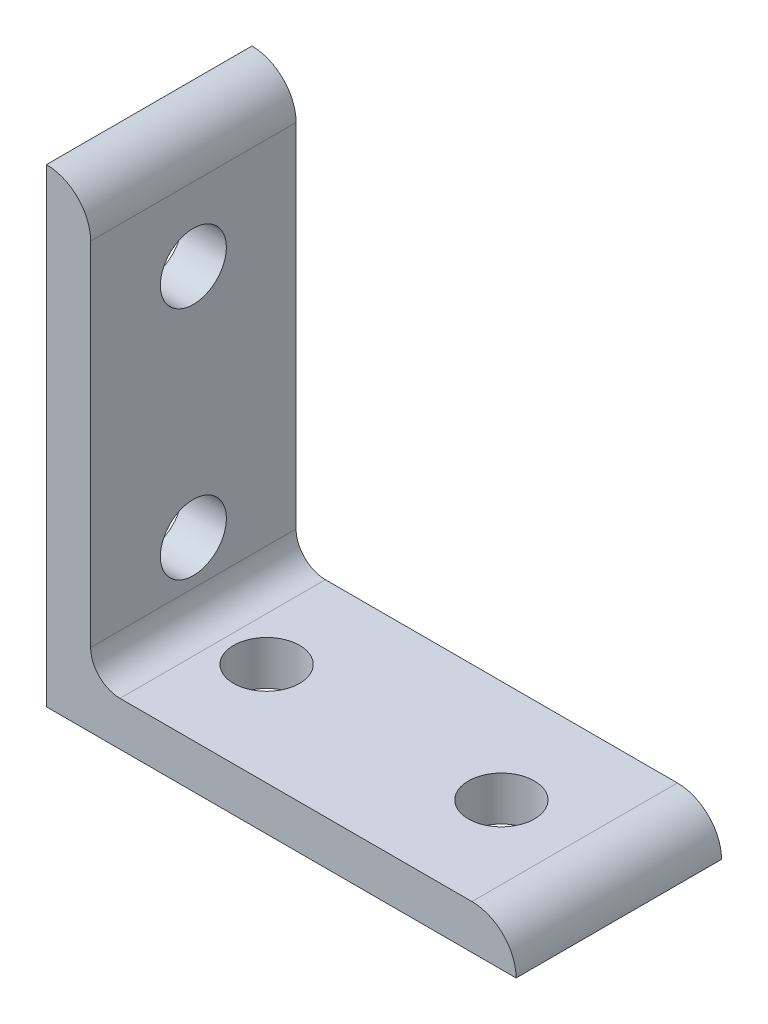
ISO-10303-21;
HEADER;
FILE_DESCRIPTION(('STEP AP214'),'2;1');
FILE_NAME('part.step','',(''),(''),'','','');
FILE_SCHEMA(('AUTOMOTIVE_DESIGN { 1 0 10303 214 1 1 1 1 }'));
ENDSEC;
DATA;
#1=APPLICATION_CONTEXT('core data for automotive mechanical design processes');
#2=APPLICATION_PROTOCOL_DEFINITION('international standard','automotive_design',2000,#1);
#3=PRODUCT_CONTEXT('',#1,'mechanical');
#4=PRODUCT('Part','Part','',(#3));
#5=PRODUCT_RELATED_PRODUCT_CATEGORY('part','',(#4));
#6=PRODUCT_DEFINITION_FORMATION('','',#4);
#7=PRODUCT_DEFINITION_CONTEXT('part definition',#1,'design');
#8=PRODUCT_DEFINITION('design','',#6,#7);
#9=PRODUCT_DEFINITION_SHAPE('','',#8);
#10=(LENGTH_UNIT() NAMED_UNIT(*) SI_UNIT(.MILLI.,.METRE.));
#11=(NAMED_UNIT(*) PLANE_ANGLE_UNIT() SI_UNIT($,.RADIAN.));
#12=(NAMED_UNIT(*) SI_UNIT($,.STERADIAN.) SOLID_ANGLE_UNIT());
#13=UNCERTAINTY_MEASURE_WITH_UNIT(LENGTH_MEASURE(1.E-05),#10,'distance_accuracy_value','');
#14=(GEOMETRIC_REPRESENTATION_CONTEXT(3) GLOBAL_UNCERTAINTY_ASSIGNED_CONTEXT((#13)) GLOBAL_UNIT_ASSIGNED_CONTEXT((#10,
#11,#12)) REPRESENTATION_CONTEXT('',''));
#15=CARTESIAN_POINT('',(0.,0.,0.));
#16=DIRECTION('',(0.,0.,1.));
#17=DIRECTION('',(1.,0.,0.));
#18=AXIS2_PLACEMENT_3D('',#15,#16,#17);
#19=CARTESIAN_POINT('',(4.7752,46.0248,11.1125));
#20=DIRECTION('',(-1.,0.,0.));
#21=DIRECTION('',(0.,-1.,0.));
#22=AXIS2_PLACEMENT_3D('',#19,#20,#21);
#23=PLANE('',#22);
#24=CARTESIAN_POINT('',(4.7752,12.7,0.));
#25=DIRECTION('',(-1.,0.,0.));
#26=DIRECTION('',(0.,-1.,0.));
#27=AXIS2_PLACEMENT_3D('',#24,#25,#26);
#28=CIRCLE('',#27,3.5687);
#29=CARTESIAN_POINT('',(4.77520000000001,12.7,3.5687));
#30=VERTEX_POINT('',#29);
#31=EDGE_CURVE('E194',#30,#30,#28,.F.);
#32=ORIENTED_EDGE('',*,*,#31,.F.);
#33=EDGE_LOOP('',(#32));
#34=FACE_BOUND('',#33,.T.);
#35=DIRECTION('',(0.,1.,0.));
#36=VECTOR('',#35,1.);
#37=CARTESIAN_POINT('',(4.7752,46.0248,-11.1125));
#38=LINE('',#37,#36);
#39=CARTESIAN_POINT('',(4.7752,7.9502,-11.1125));
#40=VERTEX_POINT('',#39);
#41=CARTESIAN_POINT('',(4.77519999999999,46.0248,-11.1125));
#42=VERTEX_POINT('',#41);
#43=EDGE_CURVE('E115',#40,#42,#38,.T.);
#44=ORIENTED_EDGE('',*,*,#43,.T.);
#45=DIRECTION('',(0.,0.,-1.));
#46=VECTOR('',#45,1.);
#47=CARTESIAN_POINT('',(4.77519999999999,46.0248,11.1125));
#48=LINE('',#47,#46);
#49=CARTESIAN_POINT('',(4.77519999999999,46.0248,11.1125));
#50=VERTEX_POINT('',#49);
#51=EDGE_CURVE('E112',#50,#42,#48,.T.);
#52=ORIENTED_EDGE('',*,*,#51,.F.);
#53=DIRECTION('',(0.,1.,0.));
#54=VECTOR('',#53,1.);
#55=CARTESIAN_POINT('',(4.7752,46.0248,11.1125));
#56=LINE('',#55,#54);
#57=CARTESIAN_POINT('',(4.7752,7.9502,11.1125));
#58=VERTEX_POINT('',#57);
#59=EDGE_CURVE('E101',#58,#50,#56,.T.);
#60=ORIENTED_EDGE('',*,*,#59,.F.);
#61=DIRECTION('',(0.,0.,-1.));
#62=VECTOR('',#61,1.);
#63=CARTESIAN_POINT('',(4.7752,7.9502,11.1125));
#64=LINE('',#63,#62);
#65=EDGE_CURVE('E116',#58,#40,#64,.T.);
#66=ORIENTED_EDGE('',*,*,#65,.T.);
#67=EDGE_LOOP('',(#44,#52,#60,#66));
#68=FACE_BOUND('',#67,.T.);
#69=CARTESIAN_POINT('',(4.77519999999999,38.1,0.));
#70=DIRECTION('',(-1.,0.,0.));
#71=DIRECTION('',(0.,-1.,0.));
#72=AXIS2_PLACEMENT_3D('',#69,#70,#71);
#73=CIRCLE('',#72,3.5687);
#74=CARTESIAN_POINT('',(4.77519999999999,38.1,3.5687));
#75=VERTEX_POINT('',#74);
#76=EDGE_CURVE('E187',#75,#75,#73,.F.);
#77=ORIENTED_EDGE('',*,*,#76,.F.);
#78=EDGE_LOOP('',(#77));
#79=FACE_BOUND('',#78,.T.);
#80=ADVANCED_FACE('F32',(#34,#68,#79),#23,.F.);
#81=CARTESIAN_POINT('',(0.,0.,11.1125));
#82=DIRECTION('',(1.,0.,0.));
#83=DIRECTION('',(0.,0.,-1.));
#84=AXIS2_PLACEMENT_3D('',#81,#82,#83);
#85=PLANE('',#84);
#86=CARTESIAN_POINT('',(0.,12.7,0.));
#87=DIRECTION('',(1.,0.,0.));
#88=DIRECTION('',(0.,0.,-1.));
#89=AXIS2_PLACEMENT_3D('',#86,#87,#88);
#90=CIRCLE('',#89,3.5687);
#91=CARTESIAN_POINT('',(0.,12.7,3.5687));
#92=VERTEX_POINT('',#91);
#93=EDGE_CURVE('E190',#92,#92,#90,.T.);
#94=ORIENTED_EDGE('',*,*,#93,.T.);
#95=EDGE_LOOP('',(#94));
#96=FACE_BOUND('',#95,.T.);
#97=DIRECTION('',(0.,-1.,0.));
#98=VECTOR('',#97,1.);
#99=CARTESIAN_POINT('',(0.,0.,-11.1125));
#100=LINE('',#99,#98);
#101=CARTESIAN_POINT('',(0.,50.8,-11.1125));
#102=VERTEX_POINT('',#101);
#103=CARTESIAN_POINT('',(0.,0.,-11.1125));
#104=VERTEX_POINT('',#103);
#105=EDGE_CURVE('E83',#102,#104,#100,.T.);
#106=ORIENTED_EDGE('',*,*,#105,.T.);
#107=DIRECTION('',(0.,0.,-1.));
#108=VECTOR('',#107,1.);
#109=CARTESIAN_POINT('',(0.,0.,11.1125));
#110=LINE('',#109,#108);
#111=CARTESIAN_POINT('',(0.,0.,11.1125));
#112=VERTEX_POINT('',#111);
#113=EDGE_CURVE('E121',#112,#104,#110,.T.);
#114=ORIENTED_EDGE('',*,*,#113,.F.);
#115=DIRECTION('',(0.,-1.,0.));
#116=VECTOR('',#115,1.);
#117=CARTESIAN_POINT('',(0.,0.,11.1125));
#118=LINE('',#117,#116);
#119=CARTESIAN_POINT('',(0.,50.8,11.1125));
#120=VERTEX_POINT('',#119);
#121=EDGE_CURVE('E51',#120,#112,#118,.T.);
#122=ORIENTED_EDGE('',*,*,#121,.F.);
#123=DIRECTION('',(0.,0.,-1.));
#124=VECTOR('',#123,1.);
#125=CARTESIAN_POINT('',(0.,50.8,11.1125));
#126=LINE('',#125,#124);
#127=EDGE_CURVE('E117',#120,#102,#126,.T.);
#128=ORIENTED_EDGE('',*,*,#127,.T.);
#129=EDGE_LOOP('',(#106,#114,#122,#128));
#130=FACE_BOUND('',#129,.T.);
#131=CARTESIAN_POINT('',(0.,38.1,0.));
#132=DIRECTION('',(1.,0.,0.));
#133=DIRECTION('',(0.,0.,-1.));
#134=AXIS2_PLACEMENT_3D('',#131,#132,#133);
#135=CIRCLE('',#134,3.5687);
#136=CARTESIAN_POINT('',(0.,38.1,3.5687));
#137=VERTEX_POINT('',#136);
#138=EDGE_CURVE('E185',#137,#137,#135,.T.);
#139=ORIENTED_EDGE('',*,*,#138,.T.);
#140=EDGE_LOOP('',(#139));
#141=FACE_BOUND('',#140,.T.);
#142=ADVANCED_FACE('F178',(#96,#130,#141),#85,.F.);
#143=CARTESIAN_POINT('',(50.8,0.,11.1125));
#144=DIRECTION('',(0.,1.,0.));
#145=DIRECTION('',(-1.,0.,0.));
#146=AXIS2_PLACEMENT_3D('',#143,#144,#145);
#147=PLANE('',#146);
#148=CARTESIAN_POINT('',(12.7,0.,0.));
#149=DIRECTION('',(0.,1.,0.));
#150=DIRECTION('',(0.,0.,1.));
#151=AXIS2_PLACEMENT_3D('',#148,#149,#150);
#152=CIRCLE('',#151,3.5687);
#153=CARTESIAN_POINT('',(12.7,0.,-3.5687));
#154=VERTEX_POINT('',#153);
#155=EDGE_CURVE('E147',#154,#154,#152,.T.);
#156=ORIENTED_EDGE('',*,*,#155,.T.);
#157=EDGE_LOOP('',(#156));
#158=FACE_BOUND('',#157,.T.);
#159=DIRECTION('',(1.,0.,0.));
#160=VECTOR('',#159,1.);
#161=CARTESIAN_POINT('',(50.8,0.,-11.1125));
#162=LINE('',#161,#160);
#163=CARTESIAN_POINT('',(50.8,0.,-11.1125));
#164=VERTEX_POINT('',#163);
#165=EDGE_CURVE('E125',#104,#164,#162,.T.);
#166=ORIENTED_EDGE('',*,*,#165,.T.);
#167=DIRECTION('',(0.,0.,-1.));
#168=VECTOR('',#167,1.);
#169=CARTESIAN_POINT('',(50.8,0.,11.1125));
#170=LINE('',#169,#168);
#171=CARTESIAN_POINT('',(50.8,0.,11.1125));
#172=VERTEX_POINT('',#171);
#173=EDGE_CURVE('E11',#172,#164,#170,.T.);
#174=ORIENTED_EDGE('',*,*,#173,.F.);
#175=DIRECTION('',(1.,0.,0.));
#176=VECTOR('',#175,1.);
#177=CARTESIAN_POINT('',(50.8,0.,11.1125));
#178=LINE('',#177,#176);
#179=EDGE_CURVE('E138',#112,#172,#178,.T.);
#180=ORIENTED_EDGE('',*,*,#179,.F.);
#181=ORIENTED_EDGE('',*,*,#113,.T.);
#182=EDGE_LOOP('',(#166,#174,#180,#181));
#183=FACE_BOUND('',#182,.T.);
#184=CARTESIAN_POINT('',(38.1,0.,0.));
#185=DIRECTION('',(0.,1.,0.));
#186=DIRECTION('',(0.,0.,1.));
#187=AXIS2_PLACEMENT_3D('',#184,#185,#186);
#188=CIRCLE('',#187,3.56869999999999);
#189=CARTESIAN_POINT('',(38.1,0.,-3.56869999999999));
#190=VERTEX_POINT('',#189);
#191=EDGE_CURVE('E155',#190,#190,#188,.T.);
#192=ORIENTED_EDGE('',*,*,#191,.T.);
#193=EDGE_LOOP('',(#192));
#194=FACE_BOUND('',#193,.T.);
#195=ADVANCED_FACE('F34',(#158,#183,#194),#147,.F.);
#196=CARTESIAN_POINT('',(7.9502,4.7752,11.1125));
#197=DIRECTION('',(0.,-1.,0.));
#198=DIRECTION('',(1.,0.,0.));
#199=AXIS2_PLACEMENT_3D('',#196,#197,#198);
#200=PLANE('',#199);
#201=CARTESIAN_POINT('',(12.7,4.7752,0.));
#202=DIRECTION('',(0.,-1.,0.));
#203=DIRECTION('',(1.,0.,0.));
#204=AXIS2_PLACEMENT_3D('',#201,#202,#203);
#205=CIRCLE('',#204,3.5687);
#206=CARTESIAN_POINT('',(12.7,4.77520000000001,-3.5687));
#207=VERTEX_POINT('',#206);
#208=EDGE_CURVE('E129',#207,#207,#205,.F.);
#209=ORIENTED_EDGE('',*,*,#208,.F.);
#210=EDGE_LOOP('',(#209));
#211=FACE_BOUND('',#210,.T.);
#212=DIRECTION('',(-1.,0.,0.));
#213=VECTOR('',#212,1.);
#214=CARTESIAN_POINT('',(7.9502,4.7752,-11.1125));
#215=LINE('',#214,#213);
#216=CARTESIAN_POINT('',(46.0248,4.7752,-11.1125));
#217=VERTEX_POINT('',#216);
#218=CARTESIAN_POINT('',(7.9502,4.7752,-11.1125));
#219=VERTEX_POINT('',#218);
#220=EDGE_CURVE('E131',#217,#219,#215,.T.);
#221=ORIENTED_EDGE('',*,*,#220,.T.);
#222=DIRECTION('',(0.,0.,-1.));
#223=VECTOR('',#222,1.);
#224=CARTESIAN_POINT('',(7.9502,4.7752,11.1125));
#225=LINE('',#224,#223);
#226=CARTESIAN_POINT('',(7.9502,4.7752,11.1125));
#227=VERTEX_POINT('',#226);
#228=EDGE_CURVE('E142',#227,#219,#225,.T.);
#229=ORIENTED_EDGE('',*,*,#228,.F.);
#230=DIRECTION('',(-1.,0.,0.));
#231=VECTOR('',#230,1.);
#232=CARTESIAN_POINT('',(7.9502,4.7752,11.1125));
#233=LINE('',#232,#231);
#234=CARTESIAN_POINT('',(46.0248,4.7752,11.1125));
#235=VERTEX_POINT('',#234);
#236=EDGE_CURVE('E161',#235,#227,#233,.T.);
#237=ORIENTED_EDGE('',*,*,#236,.F.);
#238=DIRECTION('',(0.,0.,-1.));
#239=VECTOR('',#238,1.);
#240=CARTESIAN_POINT('',(46.0248,4.7752,11.1125));
#241=LINE('',#240,#239);
#242=EDGE_CURVE('E42',#235,#217,#241,.T.);
#243=ORIENTED_EDGE('',*,*,#242,.T.);
#244=EDGE_LOOP('',(#221,#229,#237,#243));
#245=FACE_BOUND('',#244,.T.);
#246=CARTESIAN_POINT('',(38.1,4.7752,0.));
#247=DIRECTION('',(0.,-1.,0.));
#248=DIRECTION('',(1.,0.,0.));
#249=AXIS2_PLACEMENT_3D('',#246,#247,#248);
#250=CIRCLE('',#249,3.56869999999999);
#251=CARTESIAN_POINT('',(38.1,4.77520000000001,-3.56869999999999));
#252=VERTEX_POINT('',#251);
#253=EDGE_CURVE('E36',#252,#252,#250,.F.);
#254=ORIENTED_EDGE('',*,*,#253,.F.);
#255=EDGE_LOOP('',(#254));
#256=FACE_BOUND('',#255,.T.);
#257=ADVANCED_FACE('F165',(#211,#245,#256),#200,.F.);
#258=CARTESIAN_POINT('',(46.0248,0.,11.1125));
#259=DIRECTION('',(0.,0.,-1.));
#260=DIRECTION('',(-1.,0.,0.));
#261=AXIS2_PLACEMENT_3D('',#258,#259,#260);
#262=CYLINDRICAL_SURFACE('',#261,4.7752);
#263=CARTESIAN_POINT('',(46.0248,0.,-11.1125));
#264=DIRECTION('',(0.,0.,1.));
#265=DIRECTION('',(1.,0.,0.));
#266=AXIS2_PLACEMENT_3D('',#263,#264,#265);
#267=CIRCLE('',#266,4.7752);
#268=EDGE_CURVE('E128',#164,#217,#267,.T.);
#269=ORIENTED_EDGE('',*,*,#268,.T.);
#270=ORIENTED_EDGE('',*,*,#242,.F.);
#271=CARTESIAN_POINT('',(46.0248,0.,11.1125));
#272=DIRECTION('',(0.,0.,1.));
#273=DIRECTION('',(1.,0.,0.));
#274=AXIS2_PLACEMENT_3D('',#271,#272,#273);
#275=CIRCLE('',#274,4.7752);
#276=EDGE_CURVE('E91',#172,#235,#275,.T.);
#277=ORIENTED_EDGE('',*,*,#276,.F.);
#278=ORIENTED_EDGE('',*,*,#173,.T.);
#279=EDGE_LOOP('',(#269,#270,#277,#278));
#280=FACE_BOUND('',#279,.T.);
#281=ADVANCED_FACE('F209',(#280),#262,.T.);
#282=CARTESIAN_POINT('',(7.9502,7.9502,11.1125));
#283=DIRECTION('',(0.,0.,-1.));
#284=DIRECTION('',(-1.,0.,0.));
#285=AXIS2_PLACEMENT_3D('',#282,#283,#284);
#286=CYLINDRICAL_SURFACE('',#285,3.175);
#287=CARTESIAN_POINT('',(7.9502,7.9502,-11.1125));
#288=DIRECTION('',(0.,0.,-1.));
#289=DIRECTION('',(1.,0.,0.));
#290=AXIS2_PLACEMENT_3D('',#287,#288,#289);
#291=CIRCLE('',#290,3.175);
#292=EDGE_CURVE('E133',#219,#40,#291,.T.);
#293=ORIENTED_EDGE('',*,*,#292,.T.);
#294=ORIENTED_EDGE('',*,*,#65,.F.);
#295=CARTESIAN_POINT('',(7.9502,7.9502,11.1125));
#296=DIRECTION('',(0.,0.,-1.));
#297=DIRECTION('',(1.,0.,0.));
#298=AXIS2_PLACEMENT_3D('',#295,#296,#297);
#299=CIRCLE('',#298,3.175);
#300=EDGE_CURVE('E107',#227,#58,#299,.T.);
#301=ORIENTED_EDGE('',*,*,#300,.F.);
#302=ORIENTED_EDGE('',*,*,#228,.T.);
#303=EDGE_LOOP('',(#293,#294,#301,#302));
#304=FACE_BOUND('',#303,.T.);
#305=ADVANCED_FACE('F170',(#304),#286,.F.);
#306=CARTESIAN_POINT('',(0.,46.0248,11.1125));
#307=DIRECTION('',(0.,0.,-1.));
#308=DIRECTION('',(-1.,0.,0.));
#309=AXIS2_PLACEMENT_3D('',#306,#307,#308);
#310=CYLINDRICAL_SURFACE('',#309,4.77519999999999);
#311=CARTESIAN_POINT('',(0.,46.0248,-11.1125));
#312=DIRECTION('',(0.,0.,1.));
#313=DIRECTION('',(1.,0.,0.));
#314=AXIS2_PLACEMENT_3D('',#311,#312,#313);
#315=CIRCLE('',#314,4.77519999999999);
#316=EDGE_CURVE('E77',#42,#102,#315,.T.);
#317=ORIENTED_EDGE('',*,*,#316,.T.);
#318=ORIENTED_EDGE('',*,*,#127,.F.);
#319=CARTESIAN_POINT('',(0.,46.0248,11.1125));
#320=DIRECTION('',(0.,0.,1.));
#321=DIRECTION('',(1.,0.,0.));
#322=AXIS2_PLACEMENT_3D('',#319,#320,#321);
#323=CIRCLE('',#322,4.77519999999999);
#324=EDGE_CURVE('E105',#50,#120,#323,.T.);
#325=ORIENTED_EDGE('',*,*,#324,.F.);
#326=ORIENTED_EDGE('',*,*,#51,.T.);
#327=EDGE_LOOP('',(#317,#318,#325,#326));
#328=FACE_BOUND('',#327,.T.);
#329=ADVANCED_FACE('F119',(#328),#310,.T.);
#330=CARTESIAN_POINT('',(0.,46.0248,11.1125));
#331=DIRECTION('',(0.,0.,1.));
#332=DIRECTION('',(1.,0.,0.));
#333=AXIS2_PLACEMENT_3D('',#330,#331,#332);
#334=PLANE('',#333);
#335=ORIENTED_EDGE('',*,*,#179,.T.);
#336=ORIENTED_EDGE('',*,*,#276,.T.);
#337=ORIENTED_EDGE('',*,*,#236,.T.);
#338=ORIENTED_EDGE('',*,*,#300,.T.);
#339=ORIENTED_EDGE('',*,*,#59,.T.);
#340=ORIENTED_EDGE('',*,*,#324,.T.);
#341=ORIENTED_EDGE('',*,*,#121,.T.);
#342=EDGE_LOOP('',(#335,#336,#337,#338,#339,#340,#341));
#343=FACE_BOUND('',#342,.T.);
#344=ADVANCED_FACE('F103',(#343),#334,.T.);
#345=CARTESIAN_POINT('',(0.,46.0248,-11.1125));
#346=DIRECTION('',(0.,0.,1.));
#347=DIRECTION('',(1.,0.,0.));
#348=AXIS2_PLACEMENT_3D('',#345,#346,#347);
#349=PLANE('',#348);
#350=ORIENTED_EDGE('',*,*,#165,.F.);
#351=ORIENTED_EDGE('',*,*,#105,.F.);
#352=ORIENTED_EDGE('',*,*,#316,.F.);
#353=ORIENTED_EDGE('',*,*,#43,.F.);
#354=ORIENTED_EDGE('',*,*,#292,.F.);
#355=ORIENTED_EDGE('',*,*,#220,.F.);
#356=ORIENTED_EDGE('',*,*,#268,.F.);
#357=EDGE_LOOP('',(#350,#351,#352,#353,#354,#355,#356));
#358=FACE_BOUND('',#357,.T.);
#359=ADVANCED_FACE('F173',(#358),#349,.F.);
#360=CARTESIAN_POINT('',(12.7,50.8,0.));
#361=DIRECTION('',(0.,-1.,0.));
#362=DIRECTION('',(0.,0.,-1.));
#363=AXIS2_PLACEMENT_3D('',#360,#361,#362);
#364=CYLINDRICAL_SURFACE('',#363,3.5687);
#365=CARTESIAN_POINT('',(12.7,0.,-3.5687));
#366=CARTESIAN_POINT('',(12.7,0.0497416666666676,-3.5687));
#367=CARTESIAN_POINT('',(12.7,0.0994833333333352,-3.5687));
#368=CARTESIAN_POINT('',(12.7,0.198966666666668,-3.5687));
#369=CARTESIAN_POINT('',(12.7,0.248708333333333,-3.5687));
#370=CARTESIAN_POINT('',(12.7,0.348191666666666,-3.5687));
#371=CARTESIAN_POINT('',(12.7,0.397933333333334,-3.5687));
#372=CARTESIAN_POINT('',(12.7,0.497416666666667,-3.5687));
#373=CARTESIAN_POINT('',(12.7,0.547158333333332,-3.5687));
#374=CARTESIAN_POINT('',(12.7,0.646641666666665,-3.5687));
#375=CARTESIAN_POINT('',(12.7,0.696383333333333,-3.5687));
#376=CARTESIAN_POINT('',(12.7,0.795866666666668,-3.5687));
#377=CARTESIAN_POINT('',(12.7,0.845608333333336,-3.5687));
#378=CARTESIAN_POINT('',(12.7,0.945091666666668,-3.5687));
#379=CARTESIAN_POINT('',(12.7,0.994833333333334,-3.5687));
#380=CARTESIAN_POINT('',(12.7,1.09431666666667,-3.5687));
#381=CARTESIAN_POINT('',(12.7,1.14405833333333,-3.5687));
#382=CARTESIAN_POINT('',(12.7,1.24354166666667,-3.5687));
#383=CARTESIAN_POINT('',(12.7,1.29328333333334,-3.5687));
#384=CARTESIAN_POINT('',(12.7,1.39276666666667,-3.5687));
#385=CARTESIAN_POINT('',(12.7,1.44250833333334,-3.5687));
#386=CARTESIAN_POINT('',(12.7,1.54199166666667,-3.5687));
#387=CARTESIAN_POINT('',(12.7,1.59173333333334,-3.5687));
#388=CARTESIAN_POINT('',(12.7,1.69121666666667,-3.5687));
#389=CARTESIAN_POINT('',(12.7,1.74095833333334,-3.5687));
#390=CARTESIAN_POINT('',(12.7,1.84044166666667,-3.5687));
#391=CARTESIAN_POINT('',(12.7,1.89018333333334,-3.5687));
#392=CARTESIAN_POINT('',(12.7,1.98966666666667,-3.5687));
#393=CARTESIAN_POINT('',(12.7,2.03940833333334,-3.5687));
#394=CARTESIAN_POINT('',(12.7,2.13889166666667,-3.5687));
#395=CARTESIAN_POINT('',(12.7,2.18863333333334,-3.5687));
#396=CARTESIAN_POINT('',(12.7,2.28811666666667,-3.5687));
#397=CARTESIAN_POINT('',(12.7,2.33785833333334,-3.5687));
#398=CARTESIAN_POINT('',(12.7,2.43734166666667,-3.5687));
#399=CARTESIAN_POINT('',(12.7,2.48708333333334,-3.5687));
#400=CARTESIAN_POINT('',(12.7,2.58656666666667,-3.5687));
#401=CARTESIAN_POINT('',(12.7,2.63630833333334,-3.5687));
#402=CARTESIAN_POINT('',(12.7,2.73579166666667,-3.5687));
#403=CARTESIAN_POINT('',(12.7,2.78553333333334,-3.5687));
#404=CARTESIAN_POINT('',(12.7,2.88501666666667,-3.5687));
#405=CARTESIAN_POINT('',(12.7,2.93475833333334,-3.5687));
#406=CARTESIAN_POINT('',(12.7,3.03424166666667,-3.5687));
#407=CARTESIAN_POINT('',(12.7,3.08398333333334,-3.5687));
#408=CARTESIAN_POINT('',(12.7,3.18346666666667,-3.5687));
#409=CARTESIAN_POINT('',(12.7,3.23320833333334,-3.5687));
#410=CARTESIAN_POINT('',(12.7,3.33269166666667,-3.5687));
#411=CARTESIAN_POINT('',(12.7,3.38243333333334,-3.5687));
#412=CARTESIAN_POINT('',(12.7,3.48191666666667,-3.5687));
#413=CARTESIAN_POINT('',(12.7,3.53165833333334,-3.5687));
#414=CARTESIAN_POINT('',(12.7,3.63114166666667,-3.5687));
#415=CARTESIAN_POINT('',(12.7,3.68088333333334,-3.5687));
#416=CARTESIAN_POINT('',(12.7,3.78036666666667,-3.5687));
#417=CARTESIAN_POINT('',(12.7,3.83010833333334,-3.5687));
#418=CARTESIAN_POINT('',(12.7,3.92959166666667,-3.5687));
#419=CARTESIAN_POINT('',(12.7,3.97933333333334,-3.5687));
#420=CARTESIAN_POINT('',(12.7,4.07881666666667,-3.5687));
#421=CARTESIAN_POINT('',(12.7,4.12855833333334,-3.5687));
#422=CARTESIAN_POINT('',(12.7,4.22804166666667,-3.5687));
#423=CARTESIAN_POINT('',(12.7,4.27778333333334,-3.5687));
#424=CARTESIAN_POINT('',(12.7,4.37726666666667,-3.5687));
#425=CARTESIAN_POINT('',(12.7,4.42700833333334,-3.5687));
#426=CARTESIAN_POINT('',(12.7,4.52649166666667,-3.5687));
#427=CARTESIAN_POINT('',(12.7,4.57623333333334,-3.5687));
#428=CARTESIAN_POINT('',(12.7,4.67571666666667,-3.5687));
#429=CARTESIAN_POINT('',(12.7,4.72545833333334,-3.5687));
#430=CARTESIAN_POINT('',(12.7,4.77520000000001,-3.5687));
#431=B_SPLINE_CURVE_WITH_KNOTS('',3,(#365,#366,#367,#368,#369,#370,#371,#372,#373,#374,#375,
#376,#377,#378,#379,#380,#381,#382,#383,#384,#385,#386,#387,#388,#389,#390,#391,#392,#393,#394,
#395,#396,#397,#398,#399,#400,#401,#402,#403,#404,#405,#406,#407,#408,#409,#410,#411,#412,#413,
#414,#415,#416,#417,#418,#419,#420,#421,#422,#423,#424,#425,#426,#427,#428,#429,#430),
.UNSPECIFIED.,.F.,.F.,(4,2,2,2,2,2,2,2,2,2,2,2,2,2,2,2,2,2,2,2,2,2,2,2,2,2,2,2,2,2,2,2,4),(0.,
0.149225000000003,0.298449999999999,0.447675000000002,0.596899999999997,0.746125,
0.895350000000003,1.044575,1.1938,1.343025,1.49225,1.641475,1.79070000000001,1.939925,2.08915,
2.238375,2.3876,2.53682500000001,2.68605,2.83527500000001,2.9845,3.133725,3.28295000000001,
3.432175,3.58140000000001,3.73062500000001,3.87985,4.02907500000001,4.17830000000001,
4.32752500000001,4.47675000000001,4.625975,4.77520000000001),.UNSPECIFIED.);
#432=EDGE_CURVE('BSEAM205',#154,#207,#431,.T.);
#433=ORIENTED_EDGE('',*,*,#155,.F.);
#434=ORIENTED_EDGE('',*,*,#208,.T.);
#435=ORIENTED_EDGE('',*,*,#432,.T.);
#436=ORIENTED_EDGE('',*,*,#432,.F.);
#437=EDGE_LOOP('',(#433,#435,#434,#436));
#438=FACE_BOUND('',#437,.T.);
#439=ADVANCED_FACE('F205',(#438),#364,.F.);
#440=CARTESIAN_POINT('',(38.1,50.8,0.));
#441=DIRECTION('',(0.,-1.,0.));
#442=DIRECTION('',(0.,0.,-1.));
#443=AXIS2_PLACEMENT_3D('',#440,#441,#442);
#444=CYLINDRICAL_SURFACE('',#443,3.56869999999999);
#445=CARTESIAN_POINT('',(38.1,0.,-3.56869999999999));
#446=CARTESIAN_POINT('',(38.1,0.0497416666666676,-3.56869999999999));
#447=CARTESIAN_POINT('',(38.1,0.0994833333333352,-3.56869999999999));
#448=CARTESIAN_POINT('',(38.1,0.198966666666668,-3.56869999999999));
#449=CARTESIAN_POINT('',(38.1,0.248708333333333,-3.56869999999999));
#450=CARTESIAN_POINT('',(38.1,0.348191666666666,-3.56869999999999));
#451=CARTESIAN_POINT('',(38.1,0.397933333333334,-3.56869999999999));
#452=CARTESIAN_POINT('',(38.1,0.497416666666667,-3.56869999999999));
#453=CARTESIAN_POINT('',(38.1,0.547158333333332,-3.56869999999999));
#454=CARTESIAN_POINT('',(38.1,0.646641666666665,-3.56869999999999));
#455=CARTESIAN_POINT('',(38.1,0.696383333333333,-3.56869999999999));
#456=CARTESIAN_POINT('',(38.1,0.795866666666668,-3.56869999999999));
#457=CARTESIAN_POINT('',(38.1,0.845608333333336,-3.56869999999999));
#458=CARTESIAN_POINT('',(38.1,0.945091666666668,-3.56869999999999));
#459=CARTESIAN_POINT('',(38.1,0.994833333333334,-3.56869999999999));
#460=CARTESIAN_POINT('',(38.1,1.09431666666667,-3.56869999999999));
#461=CARTESIAN_POINT('',(38.1,1.14405833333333,-3.56869999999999));
#462=CARTESIAN_POINT('',(38.1,1.24354166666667,-3.56869999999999));
#463=CARTESIAN_POINT('',(38.1,1.29328333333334,-3.56869999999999));
#464=CARTESIAN_POINT('',(38.1,1.39276666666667,-3.56869999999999));
#465=CARTESIAN_POINT('',(38.1,1.44250833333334,-3.56869999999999));
#466=CARTESIAN_POINT('',(38.1,1.54199166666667,-3.56869999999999));
#467=CARTESIAN_POINT('',(38.1,1.59173333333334,-3.56869999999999));
#468=CARTESIAN_POINT('',(38.1,1.69121666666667,-3.56869999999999));
#469=CARTESIAN_POINT('',(38.1,1.74095833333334,-3.56869999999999));
#470=CARTESIAN_POINT('',(38.1,1.84044166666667,-3.56869999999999));
#471=CARTESIAN_POINT('',(38.1,1.89018333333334,-3.56869999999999));
#472=CARTESIAN_POINT('',(38.1,1.98966666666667,-3.56869999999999));
#473=CARTESIAN_POINT('',(38.1,2.03940833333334,-3.56869999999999));
#474=CARTESIAN_POINT('',(38.1,2.13889166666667,-3.56869999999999));
#475=CARTESIAN_POINT('',(38.1,2.18863333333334,-3.56869999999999));
#476=CARTESIAN_POINT('',(38.1,2.28811666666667,-3.56869999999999));
#477=CARTESIAN_POINT('',(38.1,2.33785833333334,-3.56869999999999));
#478=CARTESIAN_POINT('',(38.1,2.43734166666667,-3.56869999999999));
#479=CARTESIAN_POINT('',(38.1,2.48708333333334,-3.56869999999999));
#480=CARTESIAN_POINT('',(38.1,2.58656666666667,-3.56869999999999));
#481=CARTESIAN_POINT('',(38.1,2.63630833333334,-3.56869999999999));
#482=CARTESIAN_POINT('',(38.1,2.73579166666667,-3.56869999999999));
#483=CARTESIAN_POINT('',(38.1,2.78553333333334,-3.56869999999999));
#484=CARTESIAN_POINT('',(38.1,2.88501666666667,-3.56869999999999));
#485=CARTESIAN_POINT('',(38.1,2.93475833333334,-3.56869999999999));
#486=CARTESIAN_POINT('',(38.1,3.03424166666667,-3.56869999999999));
#487=CARTESIAN_POINT('',(38.1,3.08398333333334,-3.56869999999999));
#488=CARTESIAN_POINT('',(38.1,3.18346666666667,-3.56869999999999));
#489=CARTESIAN_POINT('',(38.1,3.23320833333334,-3.56869999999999));
#490=CARTESIAN_POINT('',(38.1,3.33269166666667,-3.56869999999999));
#491=CARTESIAN_POINT('',(38.1,3.38243333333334,-3.56869999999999));
#492=CARTESIAN_POINT('',(38.1,3.48191666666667,-3.56869999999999));
#493=CARTESIAN_POINT('',(38.1,3.53165833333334,-3.56869999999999));
#494=CARTESIAN_POINT('',(38.1,3.63114166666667,-3.56869999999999));
#495=CARTESIAN_POINT('',(38.1,3.68088333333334,-3.56869999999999));
#496=CARTESIAN_POINT('',(38.1,3.78036666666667,-3.56869999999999));
#497=CARTESIAN_POINT('',(38.1,3.83010833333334,-3.56869999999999));
#498=CARTESIAN_POINT('',(38.1,3.92959166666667,-3.56869999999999));
#499=CARTESIAN_POINT('',(38.1,3.97933333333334,-3.56869999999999));
#500=CARTESIAN_POINT('',(38.1,4.07881666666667,-3.56869999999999));
#501=CARTESIAN_POINT('',(38.1,4.12855833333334,-3.56869999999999));
#502=CARTESIAN_POINT('',(38.1,4.22804166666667,-3.56869999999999));
#503=CARTESIAN_POINT('',(38.1,4.27778333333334,-3.56869999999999));
#504=CARTESIAN_POINT('',(38.1,4.37726666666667,-3.56869999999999));
#505=CARTESIAN_POINT('',(38.1,4.42700833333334,-3.56869999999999));
#506=CARTESIAN_POINT('',(38.1,4.52649166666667,-3.56869999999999));
#507=CARTESIAN_POINT('',(38.1,4.57623333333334,-3.56869999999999));
#508=CARTESIAN_POINT('',(38.1,4.67571666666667,-3.56869999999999));
#509=CARTESIAN_POINT('',(38.1,4.72545833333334,-3.56869999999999));
#510=CARTESIAN_POINT('',(38.1,4.77520000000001,-3.56869999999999));
#511=B_SPLINE_CURVE_WITH_KNOTS('',3,(#445,#446,#447,#448,#449,#450,#451,#452,#453,#454,#455,
#456,#457,#458,#459,#460,#461,#462,#463,#464,#465,#466,#467,#468,#469,#470,#471,#472,#473,#474,
#475,#476,#477,#478,#479,#480,#481,#482,#483,#484,#485,#486,#487,#488,#489,#490,#491,#492,#493,
#494,#495,#496,#497,#498,#499,#500,#501,#502,#503,#504,#505,#506,#507,#508,#509,#510),
.UNSPECIFIED.,.F.,.F.,(4,2,2,2,2,2,2,2,2,2,2,2,2,2,2,2,2,2,2,2,2,2,2,2,2,2,2,2,2,2,2,2,4),(0.,
0.149225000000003,0.298449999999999,0.447675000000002,0.596899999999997,0.746125,
0.895350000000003,1.044575,1.1938,1.343025,1.49225,1.641475,1.79070000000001,1.939925,2.08915,
2.238375,2.3876,2.53682500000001,2.68605,2.83527500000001,2.9845,3.133725,3.28295000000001,
3.432175,3.58140000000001,3.73062500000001,3.87985,4.02907500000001,4.17830000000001,
4.32752500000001,4.47675000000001,4.625975,4.77520000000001),.UNSPECIFIED.);
#512=EDGE_CURVE('BSEAM201',#190,#252,#511,.T.);
#513=ORIENTED_EDGE('',*,*,#191,.F.);
#514=ORIENTED_EDGE('',*,*,#253,.T.);
#515=ORIENTED_EDGE('',*,*,#512,.T.);
#516=ORIENTED_EDGE('',*,*,#512,.F.);
#517=EDGE_LOOP('',(#513,#515,#514,#516));
#518=FACE_BOUND('',#517,.T.);
#519=ADVANCED_FACE('F201',(#518),#444,.F.);
#520=CARTESIAN_POINT('',(50.8,12.7,0.));
#521=DIRECTION('',(-1.,0.,0.));
#522=DIRECTION('',(0.,0.,1.));
#523=AXIS2_PLACEMENT_3D('',#520,#521,#522);
#524=CYLINDRICAL_SURFACE('',#523,3.5687);
#525=CARTESIAN_POINT('',(0.,12.7,3.5687));
#526=CARTESIAN_POINT('',(0.0497416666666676,12.7,3.5687));
#527=CARTESIAN_POINT('',(0.0994833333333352,12.7,3.5687));
#528=CARTESIAN_POINT('',(0.198966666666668,12.7,3.5687));
#529=CARTESIAN_POINT('',(0.248708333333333,12.7,3.5687));
#530=CARTESIAN_POINT('',(0.348191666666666,12.7,3.5687));
#531=CARTESIAN_POINT('',(0.397933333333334,12.7,3.5687));
#532=CARTESIAN_POINT('',(0.497416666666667,12.7,3.5687));
#533=CARTESIAN_POINT('',(0.547158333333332,12.7,3.5687));
#534=CARTESIAN_POINT('',(0.646641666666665,12.7,3.5687));
#535=CARTESIAN_POINT('',(0.696383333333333,12.7,3.5687));
#536=CARTESIAN_POINT('',(0.795866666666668,12.7,3.5687));
#537=CARTESIAN_POINT('',(0.845608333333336,12.7,3.5687));
#538=CARTESIAN_POINT('',(0.945091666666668,12.7,3.5687));
#539=CARTESIAN_POINT('',(0.994833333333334,12.7,3.5687));
#540=CARTESIAN_POINT('',(1.09431666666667,12.7,3.5687));
#541=CARTESIAN_POINT('',(1.14405833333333,12.7,3.5687));
#542=CARTESIAN_POINT('',(1.24354166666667,12.7,3.5687));
#543=CARTESIAN_POINT('',(1.29328333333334,12.7,3.5687));
#544=CARTESIAN_POINT('',(1.39276666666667,12.7,3.5687));
#545=CARTESIAN_POINT('',(1.44250833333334,12.7,3.5687));
#546=CARTESIAN_POINT('',(1.54199166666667,12.7,3.5687));
#547=CARTESIAN_POINT('',(1.59173333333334,12.7,3.5687));
#548=CARTESIAN_POINT('',(1.69121666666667,12.7,3.5687));
#549=CARTESIAN_POINT('',(1.74095833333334,12.7,3.5687));
#550=CARTESIAN_POINT('',(1.84044166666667,12.7,3.5687));
#551=CARTESIAN_POINT('',(1.89018333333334,12.7,3.5687));
#552=CARTESIAN_POINT('',(1.98966666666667,12.7,3.5687));
#553=CARTESIAN_POINT('',(2.03940833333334,12.7,3.5687));
#554=CARTESIAN_POINT('',(2.13889166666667,12.7,3.5687));
#555=CARTESIAN_POINT('',(2.18863333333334,12.7,3.5687));
#556=CARTESIAN_POINT('',(2.28811666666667,12.7,3.5687));
#557=CARTESIAN_POINT('',(2.33785833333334,12.7,3.5687));
#558=CARTESIAN_POINT('',(2.43734166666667,12.7,3.5687));
#559=CARTESIAN_POINT('',(2.48708333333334,12.7,3.5687));
#560=CARTESIAN_POINT('',(2.58656666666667,12.7,3.5687));
#561=CARTESIAN_POINT('',(2.63630833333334,12.7,3.5687));
#562=CARTESIAN_POINT('',(2.73579166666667,12.7,3.5687));
#563=CARTESIAN_POINT('',(2.78553333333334,12.7,3.5687));
#564=CARTESIAN_POINT('',(2.88501666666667,12.7,3.5687));
#565=CARTESIAN_POINT('',(2.93475833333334,12.7,3.5687));
#566=CARTESIAN_POINT('',(3.03424166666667,12.7,3.5687));
#567=CARTESIAN_POINT('',(3.08398333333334,12.7,3.5687));
#568=CARTESIAN_POINT('',(3.18346666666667,12.7,3.5687));
#569=CARTESIAN_POINT('',(3.23320833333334,12.7,3.5687));
#570=CARTESIAN_POINT('',(3.33269166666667,12.7,3.5687));
#571=CARTESIAN_POINT('',(3.38243333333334,12.7,3.5687));
#572=CARTESIAN_POINT('',(3.48191666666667,12.7,3.5687));
#573=CARTESIAN_POINT('',(3.53165833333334,12.7,3.5687));
#574=CARTESIAN_POINT('',(3.63114166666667,12.7,3.5687));
#575=CARTESIAN_POINT('',(3.68088333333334,12.7,3.5687));
#576=CARTESIAN_POINT('',(3.78036666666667,12.7,3.5687));
#577=CARTESIAN_POINT('',(3.83010833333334,12.7,3.5687));
#578=CARTESIAN_POINT('',(3.92959166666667,12.7,3.5687));
#579=CARTESIAN_POINT('',(3.97933333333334,12.7,3.5687));
#580=CARTESIAN_POINT('',(4.07881666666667,12.7,3.5687));
#581=CARTESIAN_POINT('',(4.12855833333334,12.7,3.5687));
#582=CARTESIAN_POINT('',(4.22804166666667,12.7,3.5687));
#583=CARTESIAN_POINT('',(4.27778333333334,12.7,3.5687));
#584=CARTESIAN_POINT('',(4.37726666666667,12.7,3.5687));
#585=CARTESIAN_POINT('',(4.42700833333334,12.7,3.5687));
#586=CARTESIAN_POINT('',(4.52649166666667,12.7,3.5687));
#587=CARTESIAN_POINT('',(4.57623333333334,12.7,3.5687));
#588=CARTESIAN_POINT('',(4.67571666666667,12.7,3.5687));
#589=CARTESIAN_POINT('',(4.72545833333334,12.7,3.5687));
#590=CARTESIAN_POINT('',(4.77520000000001,12.7,3.5687));
#591=B_SPLINE_CURVE_WITH_KNOTS('',3,(#525,#526,#527,#528,#529,#530,#531,#532,#533,#534,#535,
#536,#537,#538,#539,#540,#541,#542,#543,#544,#545,#546,#547,#548,#549,#550,#551,#552,#553,#554,
#555,#556,#557,#558,#559,#560,#561,#562,#563,#564,#565,#566,#567,#568,#569,#570,#571,#572,#573,
#574,#575,#576,#577,#578,#579,#580,#581,#582,#583,#584,#585,#586,#587,#588,#589,#590),
.UNSPECIFIED.,.F.,.F.,(4,2,2,2,2,2,2,2,2,2,2,2,2,2,2,2,2,2,2,2,2,2,2,2,2,2,2,2,2,2,2,2,4),(0.,
0.149225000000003,0.298449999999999,0.447675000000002,0.596899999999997,0.746125,
0.895350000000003,1.044575,1.1938,1.343025,1.49225,1.641475,1.79070000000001,1.939925,2.08915,
2.238375,2.3876,2.53682500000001,2.68605,2.83527500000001,2.9845,3.133725,3.28295000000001,
3.432175,3.58140000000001,3.73062500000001,3.87985,4.02907500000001,4.17830000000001,
4.32752500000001,4.47675000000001,4.625975,4.77520000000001),.UNSPECIFIED.);
#592=EDGE_CURVE('BSEAM204',#92,#30,#591,.T.);
#593=ORIENTED_EDGE('',*,*,#93,.F.);
#594=ORIENTED_EDGE('',*,*,#31,.T.);
#595=ORIENTED_EDGE('',*,*,#592,.T.);
#596=ORIENTED_EDGE('',*,*,#592,.F.);
#597=EDGE_LOOP('',(#593,#595,#594,#596));
#598=FACE_BOUND('',#597,.T.);
#599=ADVANCED_FACE('F204',(#598),#524,.F.);
#600=CARTESIAN_POINT('',(50.8,38.1,0.));
#601=DIRECTION('',(-1.,0.,0.));
#602=DIRECTION('',(0.,0.,1.));
#603=AXIS2_PLACEMENT_3D('',#600,#601,#602);
#604=CYLINDRICAL_SURFACE('',#603,3.5687);
#605=CARTESIAN_POINT('',(0.,38.1,3.5687));
#606=CARTESIAN_POINT('',(0.0497416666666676,38.1,3.5687));
#607=CARTESIAN_POINT('',(0.0994833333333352,38.1,3.5687));
#608=CARTESIAN_POINT('',(0.198966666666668,38.1,3.5687));
#609=CARTESIAN_POINT('',(0.248708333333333,38.1,3.5687));
#610=CARTESIAN_POINT('',(0.348191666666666,38.1,3.5687));
#611=CARTESIAN_POINT('',(0.397933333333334,38.1,3.5687));
#612=CARTESIAN_POINT('',(0.497416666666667,38.1,3.5687));
#613=CARTESIAN_POINT('',(0.547158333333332,38.1,3.5687));
#614=CARTESIAN_POINT('',(0.646641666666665,38.1,3.5687));
#615=CARTESIAN_POINT('',(0.696383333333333,38.1,3.5687));
#616=CARTESIAN_POINT('',(0.795866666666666,38.1,3.5687));
#617=CARTESIAN_POINT('',(0.845608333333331,38.1,3.5687));
#618=CARTESIAN_POINT('',(0.945091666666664,38.1,3.5687));
#619=CARTESIAN_POINT('',(0.994833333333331,38.1,3.5687));
#620=CARTESIAN_POINT('',(1.09431666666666,38.1,3.5687));
#621=CARTESIAN_POINT('',(1.14405833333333,38.1,3.5687));
#622=CARTESIAN_POINT('',(1.24354166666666,38.1,3.5687));
#623=CARTESIAN_POINT('',(1.29328333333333,38.1,3.5687));
#624=CARTESIAN_POINT('',(1.39276666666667,38.1,3.5687));
#625=CARTESIAN_POINT('',(1.44250833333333,38.1,3.5687));
#626=CARTESIAN_POINT('',(1.54199166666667,38.1,3.5687));
#627=CARTESIAN_POINT('',(1.59173333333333,38.1,3.5687));
#628=CARTESIAN_POINT('',(1.69121666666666,38.1,3.5687));
#629=CARTESIAN_POINT('',(1.74095833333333,38.1,3.5687));
#630=CARTESIAN_POINT('',(1.84044166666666,38.1,3.5687));
#631=CARTESIAN_POINT('',(1.89018333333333,38.1,3.5687));
#632=CARTESIAN_POINT('',(1.98966666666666,38.1,3.5687));
#633=CARTESIAN_POINT('',(2.03940833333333,38.1,3.5687));
#634=CARTESIAN_POINT('',(2.13889166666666,38.1,3.5687));
#635=CARTESIAN_POINT('',(2.18863333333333,38.1,3.5687));
#636=CARTESIAN_POINT('',(2.28811666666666,38.1,3.5687));
#637=CARTESIAN_POINT('',(2.33785833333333,38.1,3.5687));
#638=CARTESIAN_POINT('',(2.43734166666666,38.1,3.5687));
#639=CARTESIAN_POINT('',(2.48708333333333,38.1,3.5687));
#640=CARTESIAN_POINT('',(2.58656666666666,38.1,3.5687));
#641=CARTESIAN_POINT('',(2.63630833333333,38.1,3.5687));
#642=CARTESIAN_POINT('',(2.73579166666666,38.1,3.5687));
#643=CARTESIAN_POINT('',(2.78553333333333,38.1,3.5687));
#644=CARTESIAN_POINT('',(2.88501666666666,38.1,3.5687));
#645=CARTESIAN_POINT('',(2.93475833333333,38.1,3.5687));
#646=CARTESIAN_POINT('',(3.03424166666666,38.1,3.5687));
#647=CARTESIAN_POINT('',(3.08398333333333,38.1,3.5687));
#648=CARTESIAN_POINT('',(3.18346666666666,38.1,3.5687));
#649=CARTESIAN_POINT('',(3.23320833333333,38.1,3.5687));
#650=CARTESIAN_POINT('',(3.33269166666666,38.1,3.5687));
#651=CARTESIAN_POINT('',(3.38243333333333,38.1,3.5687));
#652=CARTESIAN_POINT('',(3.48191666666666,38.1,3.5687));
#653=CARTESIAN_POINT('',(3.53165833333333,38.1,3.5687));
#654=CARTESIAN_POINT('',(3.63114166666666,38.1,3.5687));
#655=CARTESIAN_POINT('',(3.68088333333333,38.1,3.5687));
#656=CARTESIAN_POINT('',(3.78036666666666,38.1,3.5687));
#657=CARTESIAN_POINT('',(3.83010833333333,38.1,3.5687));
#658=CARTESIAN_POINT('',(3.92959166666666,38.1,3.5687));
#659=CARTESIAN_POINT('',(3.97933333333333,38.1,3.5687));
#660=CARTESIAN_POINT('',(4.07881666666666,38.1,3.5687));
#661=CARTESIAN_POINT('',(4.12855833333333,38.1,3.5687));
#662=CARTESIAN_POINT('',(4.22804166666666,38.1,3.5687));
#663=CARTESIAN_POINT('',(4.27778333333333,38.1,3.5687));
#664=CARTESIAN_POINT('',(4.37726666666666,38.1,3.5687));
#665=CARTESIAN_POINT('',(4.42700833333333,38.1,3.5687));
#666=CARTESIAN_POINT('',(4.52649166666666,38.1,3.5687));
#667=CARTESIAN_POINT('',(4.57623333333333,38.1,3.5687));
#668=CARTESIAN_POINT('',(4.67571666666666,38.1,3.5687));
#669=CARTESIAN_POINT('',(4.72545833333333,38.1,3.5687));
#670=CARTESIAN_POINT('',(4.77519999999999,38.1,3.5687));
#671=B_SPLINE_CURVE_WITH_KNOTS('',3,(#605,#606,#607,#608,#609,#610,#611,#612,#613,#614,#615,
#616,#617,#618,#619,#620,#621,#622,#623,#624,#625,#626,#627,#628,#629,#630,#631,#632,#633,#634,
#635,#636,#637,#638,#639,#640,#641,#642,#643,#644,#645,#646,#647,#648,#649,#650,#651,#652,#653,
#654,#655,#656,#657,#658,#659,#660,#661,#662,#663,#664,#665,#666,#667,#668,#669,#670),
.UNSPECIFIED.,.F.,.F.,(4,2,2,2,2,2,2,2,2,2,2,2,2,2,2,2,2,2,2,2,2,2,2,2,2,2,2,2,2,2,2,2,4),(0.,
0.149225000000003,0.298449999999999,0.447675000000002,0.596899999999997,0.746125,
0.895349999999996,1.044575,1.19379999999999,1.343025,1.49225,1.641475,1.7907,1.939925,2.08915,
2.23837499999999,2.3876,2.536825,2.68605,2.835275,2.98449999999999,3.133725,3.28294999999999,
3.432175,3.5814,3.73062499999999,3.87985,4.02907499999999,4.1783,4.32752499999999,
4.47674999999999,4.62597499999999,4.77519999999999),.UNSPECIFIED.);
#672=EDGE_CURVE('BSEAM241',#137,#75,#671,.T.);
#673=ORIENTED_EDGE('',*,*,#138,.F.);
#674=ORIENTED_EDGE('',*,*,#76,.T.);
#675=ORIENTED_EDGE('',*,*,#672,.T.);
#676=ORIENTED_EDGE('',*,*,#672,.F.);
#677=EDGE_LOOP('',(#673,#675,#674,#676));
#678=FACE_BOUND('',#677,.T.);
#679=ADVANCED_FACE('F241',(#678),#604,.F.);
#680=CLOSED_SHELL('',(#80,#142,#195,#257,#281,#305,#329,#344,#359,#439,#519,#599,#679));
#681=MANIFOLD_SOLID_BREP('B2',#680);
#682=ADVANCED_BREP_SHAPE_REPRESENTATION('',(#18,#681),#14);
#683=SHAPE_DEFINITION_REPRESENTATION(#9,#682);
ENDSEC;
END-ISO-10303-21;
